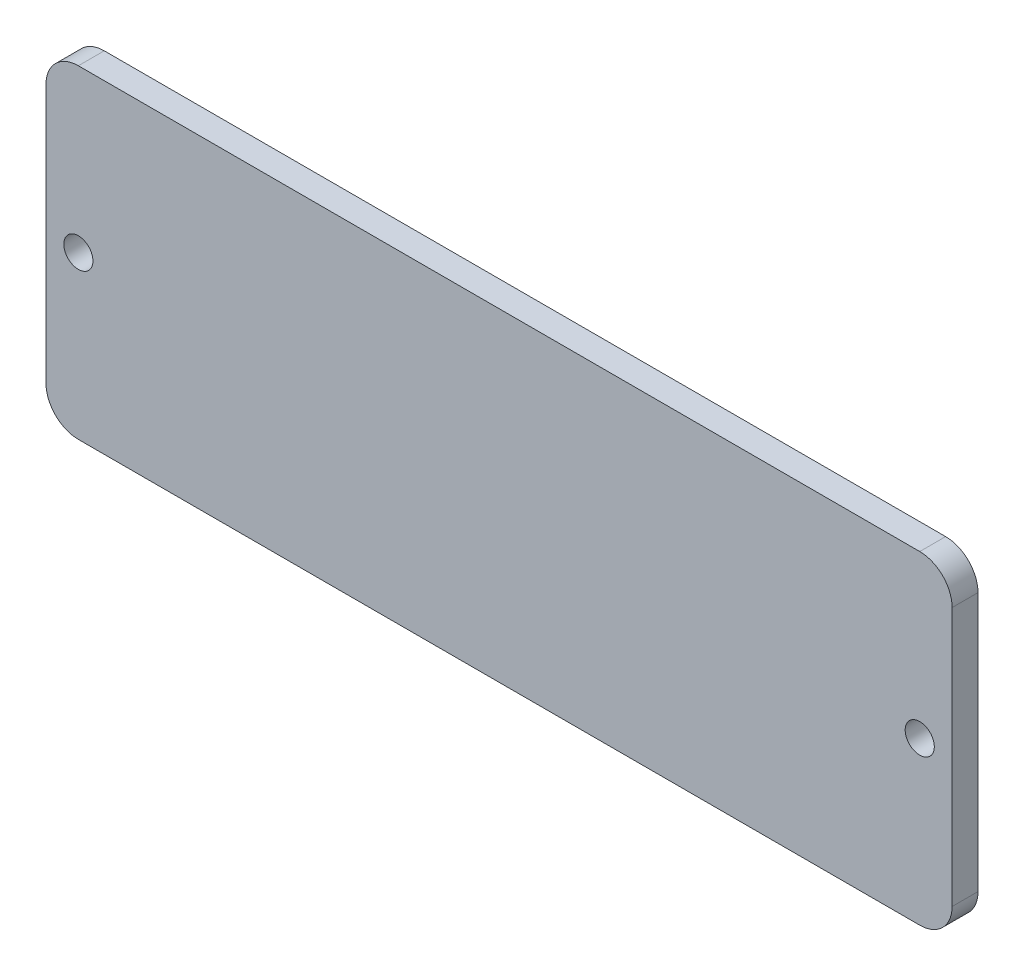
from build123d import *

# Parameters (mm, degrees)
ESQUISSE1_W        = 140
ESQUISSE1_H        = 50
ESQUISSE1_R        = 2.25
BOSS_EXTRU_1_DEPTH = 4
CONG_1_R           = 5


with BuildPart() as part:
    # Esquisse1 → Boss.-Extru.1 (new body)
    with BuildSketch(Plane.XY):
        with Locations((70, 25)):
            Rectangle(ESQUISSE1_W, ESQUISSE1_H)
        with Locations((5, 25)):
            Circle(ESQUISSE1_R, mode=Mode.SUBTRACT)
        with Locations((135, 25)):
            Circle(ESQUISSE1_R, mode=Mode.SUBTRACT)
    extrude(amount=BOSS_EXTRU_1_DEPTH)

    # Cong_1
    cong_1_edges = [part.edges().sort_by_distance(p)[0] for p in [
        (0, 50, 2),
        (140, 50, 2),
        (140, 0, 2),
        (0, 0, 2),
    ]]
    fillet(cong_1_edges, radius=CONG_1_R)


solid = part.part
